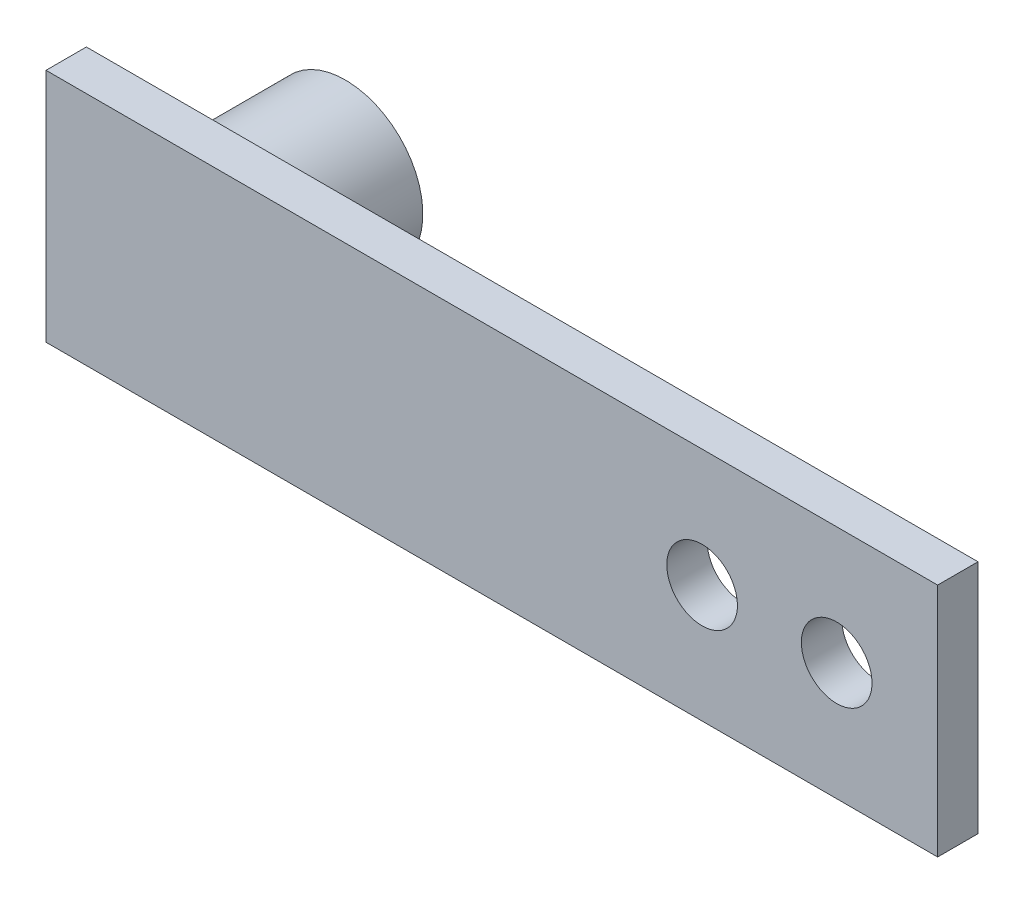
ISO-10303-21;
HEADER;
FILE_DESCRIPTION(('STEP AP214'),'2;1');
FILE_NAME('part.step','',(''),(''),'','','');
FILE_SCHEMA(('AUTOMOTIVE_DESIGN { 1 0 10303 214 1 1 1 1 }'));
ENDSEC;
DATA;
#1=APPLICATION_CONTEXT('core data for automotive mechanical design processes');
#2=APPLICATION_PROTOCOL_DEFINITION('international standard','automotive_design',2000,#1);
#3=PRODUCT_CONTEXT('',#1,'mechanical');
#4=PRODUCT('Part','Part','',(#3));
#5=PRODUCT_RELATED_PRODUCT_CATEGORY('part','',(#4));
#6=PRODUCT_DEFINITION_FORMATION('','',#4);
#7=PRODUCT_DEFINITION_CONTEXT('part definition',#1,'design');
#8=PRODUCT_DEFINITION('design','',#6,#7);
#9=PRODUCT_DEFINITION_SHAPE('','',#8);
#10=(LENGTH_UNIT() NAMED_UNIT(*) SI_UNIT(.MILLI.,.METRE.));
#11=(NAMED_UNIT(*) PLANE_ANGLE_UNIT() SI_UNIT($,.RADIAN.));
#12=(NAMED_UNIT(*) SI_UNIT($,.STERADIAN.) SOLID_ANGLE_UNIT());
#13=UNCERTAINTY_MEASURE_WITH_UNIT(LENGTH_MEASURE(1.E-05),#10,'distance_accuracy_value','');
#14=(GEOMETRIC_REPRESENTATION_CONTEXT(3) GLOBAL_UNCERTAINTY_ASSIGNED_CONTEXT((#13)) GLOBAL_UNIT_ASSIGNED_CONTEXT((#10,
#11,#12)) REPRESENTATION_CONTEXT('',''));
#15=CARTESIAN_POINT('',(0.,0.,0.));
#16=DIRECTION('',(0.,0.,1.));
#17=DIRECTION('',(1.,0.,0.));
#18=AXIS2_PLACEMENT_3D('',#15,#16,#17);
#19=CARTESIAN_POINT('',(-17.5,17.5,20.));
#20=DIRECTION('',(0.,0.,1.));
#21=DIRECTION('',(0.,-1.,0.));
#22=AXIS2_PLACEMENT_3D('',#19,#20,#21);
#23=PLANE('',#22);
#24=CARTESIAN_POINT('',(0.,0.,20.));
#25=DIRECTION('',(0.,0.,-1.));
#26=DIRECTION('',(-1.,0.,0.));
#27=AXIS2_PLACEMENT_3D('',#24,#25,#26);
#28=CIRCLE('',#27,11.5);
#29=CARTESIAN_POINT('',(-11.5,0.,20.));
#30=VERTEX_POINT('',#29);
#31=CARTESIAN_POINT('',(0.,11.5,20.));
#32=VERTEX_POINT('',#31);
#33=EDGE_CURVE('E25',#30,#32,#28,.T.);
#34=ORIENTED_EDGE('',*,*,#33,.F.);
#35=DIRECTION('',(0.,-1.,0.));
#36=VECTOR('',#35,1.);
#37=CARTESIAN_POINT('',(-11.5,11.5,20.));
#38=LINE('',#37,#36);
#39=CARTESIAN_POINT('',(-11.5,11.5,20.));
#40=VERTEX_POINT('',#39);
#41=EDGE_CURVE('E96',#40,#30,#38,.T.);
#42=ORIENTED_EDGE('',*,*,#41,.F.);
#43=DIRECTION('',(-1.,0.,0.));
#44=VECTOR('',#43,1.);
#45=CARTESIAN_POINT('',(11.5,11.5,20.));
#46=LINE('',#45,#44);
#47=EDGE_CURVE('E111',#32,#40,#46,.T.);
#48=ORIENTED_EDGE('',*,*,#47,.F.);
#49=EDGE_LOOP('',(#34,#42,#48));
#50=FACE_BOUND('',#49,.T.);
#51=ADVANCED_FACE('F14',(#50),#23,.F.);
#52=CARTESIAN_POINT('',(11.5,0.,20.));
#53=VERTEX_POINT('',#52);
#54=EDGE_CURVE('E9',#32,#53,#28,.T.);
#55=ORIENTED_EDGE('',*,*,#54,.F.);
#56=CARTESIAN_POINT('',(11.5,11.5,20.));
#57=VERTEX_POINT('',#56);
#58=EDGE_CURVE('E109',#57,#32,#46,.T.);
#59=ORIENTED_EDGE('',*,*,#58,.F.);
#60=DIRECTION('',(0.,1.,0.));
#61=VECTOR('',#60,1.);
#62=CARTESIAN_POINT('',(11.5,11.5,20.));
#63=LINE('',#62,#61);
#64=EDGE_CURVE('E175',#53,#57,#63,.T.);
#65=ORIENTED_EDGE('',*,*,#64,.F.);
#66=EDGE_LOOP('',(#55,#59,#65));
#67=FACE_BOUND('',#66,.T.);
#68=ADVANCED_FACE('F193',(#67),#23,.F.);
#69=CARTESIAN_POINT('',(0.,-11.5,20.));
#70=VERTEX_POINT('',#69);
#71=EDGE_CURVE('E23',#53,#70,#28,.T.);
#72=ORIENTED_EDGE('',*,*,#71,.F.);
#73=CARTESIAN_POINT('',(11.5,-11.5,20.));
#74=VERTEX_POINT('',#73);
#75=EDGE_CURVE('E163',#74,#53,#63,.T.);
#76=ORIENTED_EDGE('',*,*,#75,.F.);
#77=DIRECTION('',(1.,0.,0.));
#78=VECTOR('',#77,1.);
#79=CARTESIAN_POINT('',(11.5,-11.5,20.));
#80=LINE('',#79,#78);
#81=EDGE_CURVE('E103',#70,#74,#80,.T.);
#82=ORIENTED_EDGE('',*,*,#81,.F.);
#83=EDGE_LOOP('',(#72,#76,#82));
#84=FACE_BOUND('',#83,.T.);
#85=ADVANCED_FACE('F196',(#84),#23,.F.);
#86=EDGE_CURVE('E38',#70,#30,#28,.T.);
#87=ORIENTED_EDGE('',*,*,#86,.F.);
#88=CARTESIAN_POINT('',(-11.5,-11.5,20.));
#89=VERTEX_POINT('',#88);
#90=EDGE_CURVE('E107',#89,#70,#80,.T.);
#91=ORIENTED_EDGE('',*,*,#90,.F.);
#92=EDGE_CURVE('E98',#30,#89,#38,.T.);
#93=ORIENTED_EDGE('',*,*,#92,.F.);
#94=EDGE_LOOP('',(#87,#91,#93));
#95=FACE_BOUND('',#94,.T.);
#96=ADVANCED_FACE('F105',(#95),#23,.F.);
#97=CARTESIAN_POINT('',(11.5,11.5,21.));
#98=DIRECTION('',(0.,-1.,0.));
#99=DIRECTION('',(1.,0.,0.));
#100=AXIS2_PLACEMENT_3D('',#97,#98,#99);
#101=PLANE('',#100);
#102=ORIENTED_EDGE('',*,*,#58,.T.);
#103=ORIENTED_EDGE('',*,*,#47,.T.);
#104=DIRECTION('',(0.,0.,-1.));
#105=VECTOR('',#104,1.);
#106=CARTESIAN_POINT('',(-11.5,11.5,21.));
#107=LINE('',#106,#105);
#108=CARTESIAN_POINT('',(-11.5,11.5,21.));
#109=VERTEX_POINT('',#108);
#110=EDGE_CURVE('E100',#109,#40,#107,.T.);
#111=ORIENTED_EDGE('',*,*,#110,.F.);
#112=DIRECTION('',(-1.,0.,0.));
#113=VECTOR('',#112,1.);
#114=CARTESIAN_POINT('',(11.5,11.5,21.));
#115=LINE('',#114,#113);
#116=CARTESIAN_POINT('',(11.5,11.5,21.));
#117=VERTEX_POINT('',#116);
#118=EDGE_CURVE('E159',#117,#109,#115,.T.);
#119=ORIENTED_EDGE('',*,*,#118,.F.);
#120=DIRECTION('',(0.,0.,-1.));
#121=VECTOR('',#120,1.);
#122=CARTESIAN_POINT('',(11.5,11.5,21.));
#123=LINE('',#122,#121);
#124=EDGE_CURVE('E172',#117,#57,#123,.T.);
#125=ORIENTED_EDGE('',*,*,#124,.T.);
#126=EDGE_LOOP('',(#102,#103,#111,#119,#125));
#127=FACE_BOUND('',#126,.T.);
#128=ADVANCED_FACE('F16',(#127),#101,.F.);
#129=CARTESIAN_POINT('',(-11.5,11.5,21.));
#130=DIRECTION('',(1.,0.,0.));
#131=DIRECTION('',(0.,0.,1.));
#132=AXIS2_PLACEMENT_3D('',#129,#130,#131);
#133=PLANE('',#132);
#134=ORIENTED_EDGE('',*,*,#41,.T.);
#135=ORIENTED_EDGE('',*,*,#92,.T.);
#136=DIRECTION('',(0.,0.,-1.));
#137=VECTOR('',#136,1.);
#138=CARTESIAN_POINT('',(-11.5,-11.5,21.));
#139=LINE('',#138,#137);
#140=CARTESIAN_POINT('',(-11.5,-11.5,21.));
#141=VERTEX_POINT('',#140);
#142=EDGE_CURVE('E117',#141,#89,#139,.T.);
#143=ORIENTED_EDGE('',*,*,#142,.F.);
#144=DIRECTION('',(0.,-1.,0.));
#145=VECTOR('',#144,1.);
#146=CARTESIAN_POINT('',(-11.5,11.5,21.));
#147=LINE('',#146,#145);
#148=EDGE_CURVE('E162',#109,#141,#147,.T.);
#149=ORIENTED_EDGE('',*,*,#148,.F.);
#150=ORIENTED_EDGE('',*,*,#110,.T.);
#151=EDGE_LOOP('',(#134,#135,#143,#149,#150));
#152=FACE_BOUND('',#151,.T.);
#153=ADVANCED_FACE('F97',(#152),#133,.F.);
#154=CARTESIAN_POINT('',(11.5,-11.5,21.));
#155=DIRECTION('',(0.,1.,0.));
#156=DIRECTION('',(-1.,0.,0.));
#157=AXIS2_PLACEMENT_3D('',#154,#155,#156);
#158=PLANE('',#157);
#159=ORIENTED_EDGE('',*,*,#90,.T.);
#160=ORIENTED_EDGE('',*,*,#81,.T.);
#161=DIRECTION('',(0.,0.,-1.));
#162=VECTOR('',#161,1.);
#163=CARTESIAN_POINT('',(11.5,-11.5,21.));
#164=LINE('',#163,#162);
#165=CARTESIAN_POINT('',(11.5,-11.5,21.));
#166=VERTEX_POINT('',#165);
#167=EDGE_CURVE('E180',#166,#74,#164,.T.);
#168=ORIENTED_EDGE('',*,*,#167,.F.);
#169=DIRECTION('',(1.,0.,0.));
#170=VECTOR('',#169,1.);
#171=CARTESIAN_POINT('',(11.5,-11.5,21.));
#172=LINE('',#171,#170);
#173=EDGE_CURVE('E166',#141,#166,#172,.T.);
#174=ORIENTED_EDGE('',*,*,#173,.F.);
#175=ORIENTED_EDGE('',*,*,#142,.T.);
#176=EDGE_LOOP('',(#159,#160,#168,#174,#175));
#177=FACE_BOUND('',#176,.T.);
#178=ADVANCED_FACE('F185',(#177),#158,.F.);
#179=CARTESIAN_POINT('',(11.5,11.5,21.));
#180=DIRECTION('',(-1.,0.,0.));
#181=DIRECTION('',(0.,0.,-1.));
#182=AXIS2_PLACEMENT_3D('',#179,#180,#181);
#183=PLANE('',#182);
#184=ORIENTED_EDGE('',*,*,#75,.T.);
#185=ORIENTED_EDGE('',*,*,#64,.T.);
#186=ORIENTED_EDGE('',*,*,#124,.F.);
#187=DIRECTION('',(0.,1.,0.));
#188=VECTOR('',#187,1.);
#189=CARTESIAN_POINT('',(11.5,11.5,21.));
#190=LINE('',#189,#188);
#191=EDGE_CURVE('E169',#166,#117,#190,.T.);
#192=ORIENTED_EDGE('',*,*,#191,.F.);
#193=ORIENTED_EDGE('',*,*,#167,.T.);
#194=EDGE_LOOP('',(#184,#185,#186,#192,#193));
#195=FACE_BOUND('',#194,.T.);
#196=ADVANCED_FACE('F192',(#195),#183,.F.);
#197=CARTESIAN_POINT('',(-17.5,17.5,21.));
#198=DIRECTION('',(0.,0.,1.));
#199=DIRECTION('',(0.,-1.,0.));
#200=AXIS2_PLACEMENT_3D('',#197,#198,#199);
#201=PLANE('',#200);
#202=CARTESIAN_POINT('',(80.,0.,21.));
#203=DIRECTION('',(0.,0.,1.));
#204=DIRECTION('',(0.,-1.,0.));
#205=AXIS2_PLACEMENT_3D('',#202,#203,#204);
#206=CIRCLE('',#205,5.25);
#207=CARTESIAN_POINT('',(80.,-5.25,21.));
#208=VERTEX_POINT('',#207);
#209=EDGE_CURVE('E123',#208,#208,#206,.T.);
#210=ORIENTED_EDGE('',*,*,#209,.T.);
#211=EDGE_LOOP('',(#210));
#212=FACE_BOUND('',#211,.T.);
#213=CARTESIAN_POINT('',(100.,0.,21.));
#214=DIRECTION('',(0.,0.,1.));
#215=DIRECTION('',(0.,-1.,0.));
#216=AXIS2_PLACEMENT_3D('',#213,#214,#215);
#217=CIRCLE('',#216,5.25);
#218=CARTESIAN_POINT('',(100.,-5.25,21.));
#219=VERTEX_POINT('',#218);
#220=EDGE_CURVE('E18',#219,#219,#217,.T.);
#221=ORIENTED_EDGE('',*,*,#220,.T.);
#222=EDGE_LOOP('',(#221));
#223=FACE_BOUND('',#222,.T.);
#224=DIRECTION('',(-1.,0.,0.));
#225=VECTOR('',#224,1.);
#226=CARTESIAN_POINT('',(115.,17.5,21.));
#227=LINE('',#226,#225);
#228=CARTESIAN_POINT('',(115.,17.5,21.));
#229=VERTEX_POINT('',#228);
#230=CARTESIAN_POINT('',(-17.5,17.5,21.));
#231=VERTEX_POINT('',#230);
#232=EDGE_CURVE('E140',#229,#231,#227,.T.);
#233=ORIENTED_EDGE('',*,*,#232,.F.);
#234=DIRECTION('',(0.,1.,0.));
#235=VECTOR('',#234,1.);
#236=CARTESIAN_POINT('',(115.,17.5,21.));
#237=LINE('',#236,#235);
#238=CARTESIAN_POINT('',(115.,-17.5,21.));
#239=VERTEX_POINT('',#238);
#240=EDGE_CURVE('E133',#239,#229,#237,.T.);
#241=ORIENTED_EDGE('',*,*,#240,.F.);
#242=DIRECTION('',(1.,0.,0.));
#243=VECTOR('',#242,1.);
#244=CARTESIAN_POINT('',(115.,-17.5,21.));
#245=LINE('',#244,#243);
#246=CARTESIAN_POINT('',(-17.5,-17.5,21.));
#247=VERTEX_POINT('',#246);
#248=EDGE_CURVE('E145',#247,#239,#245,.T.);
#249=ORIENTED_EDGE('',*,*,#248,.F.);
#250=DIRECTION('',(0.,-1.,0.));
#251=VECTOR('',#250,1.);
#252=CARTESIAN_POINT('',(-17.5,17.5,21.));
#253=LINE('',#252,#251);
#254=EDGE_CURVE('E143',#231,#247,#253,.T.);
#255=ORIENTED_EDGE('',*,*,#254,.F.);
#256=EDGE_LOOP('',(#233,#241,#249,#255));
#257=FACE_BOUND('',#256,.T.);
#258=ORIENTED_EDGE('',*,*,#191,.T.);
#259=ORIENTED_EDGE('',*,*,#118,.T.);
#260=ORIENTED_EDGE('',*,*,#148,.T.);
#261=ORIENTED_EDGE('',*,*,#173,.T.);
#262=EDGE_LOOP('',(#258,#259,#260,#261));
#263=FACE_BOUND('',#262,.T.);
#264=ADVANCED_FACE('F189',(#212,#223,#257,#263),#201,.F.);
#265=CARTESIAN_POINT('',(115.,17.5,27.));
#266=DIRECTION('',(0.,-1.,0.));
#267=DIRECTION('',(1.,0.,0.));
#268=AXIS2_PLACEMENT_3D('',#265,#266,#267);
#269=PLANE('',#268);
#270=ORIENTED_EDGE('',*,*,#232,.T.);
#271=DIRECTION('',(0.,0.,-1.));
#272=VECTOR('',#271,1.);
#273=CARTESIAN_POINT('',(-17.5,17.5,27.));
#274=LINE('',#273,#272);
#275=CARTESIAN_POINT('',(-17.5,17.5,27.));
#276=VERTEX_POINT('',#275);
#277=EDGE_CURVE('E156',#276,#231,#274,.T.);
#278=ORIENTED_EDGE('',*,*,#277,.F.);
#279=DIRECTION('',(-1.,0.,0.));
#280=VECTOR('',#279,1.);
#281=CARTESIAN_POINT('',(115.,17.5,27.));
#282=LINE('',#281,#280);
#283=CARTESIAN_POINT('',(115.,17.5,27.));
#284=VERTEX_POINT('',#283);
#285=EDGE_CURVE('E129',#284,#276,#282,.T.);
#286=ORIENTED_EDGE('',*,*,#285,.F.);
#287=DIRECTION('',(0.,0.,-1.));
#288=VECTOR('',#287,1.);
#289=CARTESIAN_POINT('',(115.,17.5,27.));
#290=LINE('',#289,#288);
#291=EDGE_CURVE('E139',#284,#229,#290,.T.);
#292=ORIENTED_EDGE('',*,*,#291,.T.);
#293=EDGE_LOOP('',(#270,#278,#286,#292));
#294=FACE_BOUND('',#293,.T.);
#295=ADVANCED_FACE('F266',(#294),#269,.F.);
#296=CARTESIAN_POINT('',(-17.5,17.5,27.));
#297=DIRECTION('',(1.,0.,0.));
#298=DIRECTION('',(0.,0.,1.));
#299=AXIS2_PLACEMENT_3D('',#296,#297,#298);
#300=PLANE('',#299);
#301=ORIENTED_EDGE('',*,*,#254,.T.);
#302=DIRECTION('',(0.,0.,-1.));
#303=VECTOR('',#302,1.);
#304=CARTESIAN_POINT('',(-17.5,-17.5,27.));
#305=LINE('',#304,#303);
#306=CARTESIAN_POINT('',(-17.5,-17.5,27.));
#307=VERTEX_POINT('',#306);
#308=EDGE_CURVE('E153',#307,#247,#305,.T.);
#309=ORIENTED_EDGE('',*,*,#308,.F.);
#310=DIRECTION('',(0.,-1.,0.));
#311=VECTOR('',#310,1.);
#312=CARTESIAN_POINT('',(-17.5,17.5,27.));
#313=LINE('',#312,#311);
#314=EDGE_CURVE('E132',#276,#307,#313,.T.);
#315=ORIENTED_EDGE('',*,*,#314,.F.);
#316=ORIENTED_EDGE('',*,*,#277,.T.);
#317=EDGE_LOOP('',(#301,#309,#315,#316));
#318=FACE_BOUND('',#317,.T.);
#319=ADVANCED_FACE('F275',(#318),#300,.F.);
#320=CARTESIAN_POINT('',(115.,-17.5,27.));
#321=DIRECTION('',(0.,1.,0.));
#322=DIRECTION('',(-1.,0.,0.));
#323=AXIS2_PLACEMENT_3D('',#320,#321,#322);
#324=PLANE('',#323);
#325=ORIENTED_EDGE('',*,*,#248,.T.);
#326=DIRECTION('',(0.,0.,-1.));
#327=VECTOR('',#326,1.);
#328=CARTESIAN_POINT('',(115.,-17.5,27.));
#329=LINE('',#328,#327);
#330=CARTESIAN_POINT('',(115.,-17.5,27.));
#331=VERTEX_POINT('',#330);
#332=EDGE_CURVE('E150',#331,#239,#329,.T.);
#333=ORIENTED_EDGE('',*,*,#332,.F.);
#334=DIRECTION('',(1.,0.,0.));
#335=VECTOR('',#334,1.);
#336=CARTESIAN_POINT('',(115.,-17.5,27.));
#337=LINE('',#336,#335);
#338=EDGE_CURVE('E135',#307,#331,#337,.T.);
#339=ORIENTED_EDGE('',*,*,#338,.F.);
#340=ORIENTED_EDGE('',*,*,#308,.T.);
#341=EDGE_LOOP('',(#325,#333,#339,#340));
#342=FACE_BOUND('',#341,.T.);
#343=ADVANCED_FACE('F284',(#342),#324,.F.);
#344=CARTESIAN_POINT('',(115.,17.5,27.));
#345=DIRECTION('',(-1.,0.,0.));
#346=DIRECTION('',(0.,0.,-1.));
#347=AXIS2_PLACEMENT_3D('',#344,#345,#346);
#348=PLANE('',#347);
#349=ORIENTED_EDGE('',*,*,#240,.T.);
#350=ORIENTED_EDGE('',*,*,#291,.F.);
#351=DIRECTION('',(0.,1.,0.));
#352=VECTOR('',#351,1.);
#353=CARTESIAN_POINT('',(115.,17.5,27.));
#354=LINE('',#353,#352);
#355=EDGE_CURVE('E137',#331,#284,#354,.T.);
#356=ORIENTED_EDGE('',*,*,#355,.F.);
#357=ORIENTED_EDGE('',*,*,#332,.T.);
#358=EDGE_LOOP('',(#349,#350,#356,#357));
#359=FACE_BOUND('',#358,.T.);
#360=ADVANCED_FACE('F293',(#359),#348,.F.);
#361=CARTESIAN_POINT('',(-17.5,17.5,27.));
#362=DIRECTION('',(0.,0.,1.));
#363=DIRECTION('',(0.,-1.,0.));
#364=AXIS2_PLACEMENT_3D('',#361,#362,#363);
#365=PLANE('',#364);
#366=CARTESIAN_POINT('',(80.,0.,27.));
#367=DIRECTION('',(0.,0.,1.));
#368=DIRECTION('',(0.,-1.,0.));
#369=AXIS2_PLACEMENT_3D('',#366,#367,#368);
#370=CIRCLE('',#369,5.25);
#371=CARTESIAN_POINT('',(80.,-5.25,27.));
#372=VERTEX_POINT('',#371);
#373=EDGE_CURVE('E120',#372,#372,#370,.T.);
#374=ORIENTED_EDGE('',*,*,#373,.F.);
#375=EDGE_LOOP('',(#374));
#376=FACE_BOUND('',#375,.T.);
#377=CARTESIAN_POINT('',(100.,0.,27.));
#378=DIRECTION('',(0.,0.,1.));
#379=DIRECTION('',(0.,-1.,0.));
#380=AXIS2_PLACEMENT_3D('',#377,#378,#379);
#381=CIRCLE('',#380,5.25);
#382=CARTESIAN_POINT('',(100.,-5.25,27.));
#383=VERTEX_POINT('',#382);
#384=EDGE_CURVE('E126',#383,#383,#381,.T.);
#385=ORIENTED_EDGE('',*,*,#384,.F.);
#386=EDGE_LOOP('',(#385));
#387=FACE_BOUND('',#386,.T.);
#388=ORIENTED_EDGE('',*,*,#285,.T.);
#389=ORIENTED_EDGE('',*,*,#314,.T.);
#390=ORIENTED_EDGE('',*,*,#338,.T.);
#391=ORIENTED_EDGE('',*,*,#355,.T.);
#392=EDGE_LOOP('',(#388,#389,#390,#391));
#393=FACE_BOUND('',#392,.T.);
#394=ADVANCED_FACE('F302',(#376,#387,#393),#365,.T.);
#395=CARTESIAN_POINT('',(100.,0.,27.));
#396=DIRECTION('',(0.,0.,1.));
#397=DIRECTION('',(0.,-1.,0.));
#398=AXIS2_PLACEMENT_3D('',#395,#396,#397);
#399=CYLINDRICAL_SURFACE('',#398,5.25);
#400=ORIENTED_EDGE('',*,*,#384,.T.);
#401=EDGE_LOOP('',(#400));
#402=FACE_BOUND('',#401,.T.);
#403=ORIENTED_EDGE('',*,*,#220,.F.);
#404=EDGE_LOOP('',(#403));
#405=FACE_BOUND('',#404,.T.);
#406=ADVANCED_FACE('F311',(#402,#405),#399,.F.);
#407=CARTESIAN_POINT('',(80.,0.,27.));
#408=DIRECTION('',(0.,0.,1.));
#409=DIRECTION('',(0.,-1.,0.));
#410=AXIS2_PLACEMENT_3D('',#407,#408,#409);
#411=CYLINDRICAL_SURFACE('',#410,5.25);
#412=ORIENTED_EDGE('',*,*,#373,.T.);
#413=EDGE_LOOP('',(#412));
#414=FACE_BOUND('',#413,.T.);
#415=ORIENTED_EDGE('',*,*,#209,.F.);
#416=EDGE_LOOP('',(#415));
#417=FACE_BOUND('',#416,.T.);
#418=ADVANCED_FACE('F320',(#414,#417),#411,.F.);
#419=CARTESIAN_POINT('',(0.,0.,0.));
#420=DIRECTION('',(0.,0.,1.));
#421=DIRECTION('',(1.,0.,0.));
#422=AXIS2_PLACEMENT_3D('',#419,#420,#421);
#423=CYLINDRICAL_SURFACE('',#422,11.5);
#424=CARTESIAN_POINT('',(0.,0.,0.));
#425=DIRECTION('',(0.,0.,-1.));
#426=DIRECTION('',(-1.,0.,0.));
#427=AXIS2_PLACEMENT_3D('',#424,#425,#426);
#428=CIRCLE('',#427,11.5);
#429=CARTESIAN_POINT('',(-11.5,0.,0.));
#430=VERTEX_POINT('',#429);
#431=EDGE_CURVE('E114',#430,#430,#428,.T.);
#432=ORIENTED_EDGE('',*,*,#431,.F.);
#433=EDGE_LOOP('',(#432));
#434=FACE_BOUND('',#433,.T.);
#435=ORIENTED_EDGE('',*,*,#33,.T.);
#436=ORIENTED_EDGE('',*,*,#54,.T.);
#437=ORIENTED_EDGE('',*,*,#71,.T.);
#438=ORIENTED_EDGE('',*,*,#86,.T.);
#439=EDGE_LOOP('',(#435,#436,#437,#438));
#440=FACE_BOUND('',#439,.T.);
#441=ADVANCED_FACE('F116',(#434,#440),#423,.T.);
#442=CARTESIAN_POINT('',(0.,0.,0.));
#443=DIRECTION('',(0.,0.,-1.));
#444=DIRECTION('',(-1.,0.,0.));
#445=AXIS2_PLACEMENT_3D('',#442,#443,#444);
#446=PLANE('',#445);
#447=ORIENTED_EDGE('',*,*,#431,.T.);
#448=EDGE_LOOP('',(#447));
#449=FACE_BOUND('',#448,.T.);
#450=ADVANCED_FACE('F336',(#449),#446,.T.);
#451=CLOSED_SHELL('',(#51,#68,#85,#96,#128,#153,#178,#196,#264,#295,#319,#343,#360,#394,#406,
#418,#441,#450));
#452=MANIFOLD_SOLID_BREP('B1',#451);
#453=ADVANCED_BREP_SHAPE_REPRESENTATION('',(#18,#452),#14);
#454=SHAPE_DEFINITION_REPRESENTATION(#9,#453);
ENDSEC;
END-ISO-10303-21;
